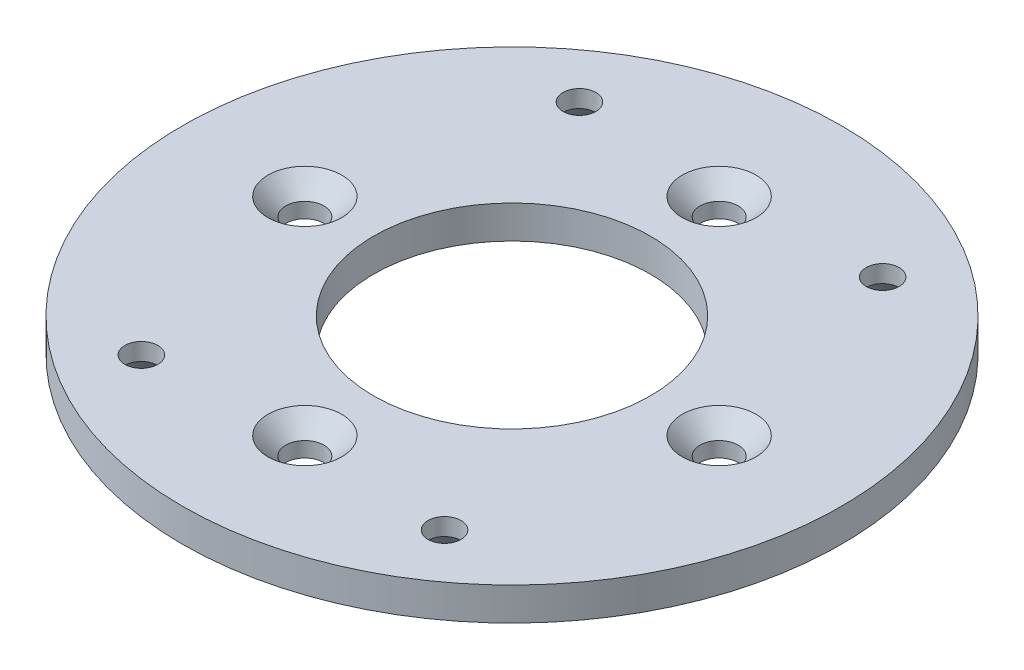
ISO-10303-21;
HEADER;
FILE_DESCRIPTION(('STEP AP214'),'2;1');
FILE_NAME('part.step','',(''),(''),'','','');
FILE_SCHEMA(('AUTOMOTIVE_DESIGN { 1 0 10303 214 1 1 1 1 }'));
ENDSEC;
DATA;
#1=APPLICATION_CONTEXT('core data for automotive mechanical design processes');
#2=APPLICATION_PROTOCOL_DEFINITION('international standard','automotive_design',2000,#1);
#3=PRODUCT_CONTEXT('',#1,'mechanical');
#4=PRODUCT('Part','Part','',(#3));
#5=PRODUCT_RELATED_PRODUCT_CATEGORY('part','',(#4));
#6=PRODUCT_DEFINITION_FORMATION('','',#4);
#7=PRODUCT_DEFINITION_CONTEXT('part definition',#1,'design');
#8=PRODUCT_DEFINITION('design','',#6,#7);
#9=PRODUCT_DEFINITION_SHAPE('','',#8);
#10=(LENGTH_UNIT() NAMED_UNIT(*) SI_UNIT(.MILLI.,.METRE.));
#11=(NAMED_UNIT(*) PLANE_ANGLE_UNIT() SI_UNIT($,.RADIAN.));
#12=(NAMED_UNIT(*) SI_UNIT($,.STERADIAN.) SOLID_ANGLE_UNIT());
#13=UNCERTAINTY_MEASURE_WITH_UNIT(LENGTH_MEASURE(1.E-05),#10,'distance_accuracy_value','');
#14=(GEOMETRIC_REPRESENTATION_CONTEXT(3) GLOBAL_UNCERTAINTY_ASSIGNED_CONTEXT((#13)) GLOBAL_UNIT_ASSIGNED_CONTEXT((#10,
#11,#12)) REPRESENTATION_CONTEXT('',''));
#15=CARTESIAN_POINT('',(0.,0.,0.));
#16=DIRECTION('',(0.,0.,1.));
#17=DIRECTION('',(1.,0.,0.));
#18=AXIS2_PLACEMENT_3D('',#15,#16,#17);
#19=CARTESIAN_POINT('',(0.,-2.,0.));
#20=DIRECTION('',(0.,1.,0.));
#21=DIRECTION('',(0.,0.,1.));
#22=AXIS2_PLACEMENT_3D('',#19,#20,#21);
#23=PLANE('',#22);
#24=CARTESIAN_POINT('',(0.,-2.,0.));
#25=DIRECTION('',(0.,1.,0.));
#26=DIRECTION('',(0.,0.,1.));
#27=AXIS2_PLACEMENT_3D('',#24,#25,#26);
#28=CIRCLE('',#27,50.);
#29=CARTESIAN_POINT('',(0.,-2.,50.));
#30=VERTEX_POINT('',#29);
#31=EDGE_CURVE('E56',#30,#30,#28,.T.);
#32=ORIENTED_EDGE('',*,*,#31,.F.);
#33=EDGE_LOOP('',(#32));
#34=FACE_BOUND('',#33,.T.);
#35=CARTESIAN_POINT('',(0.,-2.,0.));
#36=DIRECTION('',(0.,1.,0.));
#37=DIRECTION('',(0.,0.,1.));
#38=AXIS2_PLACEMENT_3D('',#35,#36,#37);
#39=CIRCLE('',#38,21.);
#40=CARTESIAN_POINT('',(0.,-2.,21.));
#41=VERTEX_POINT('',#40);
#42=EDGE_CURVE('E59',#41,#41,#39,.T.);
#43=ORIENTED_EDGE('',*,*,#42,.T.);
#44=EDGE_LOOP('',(#43));
#45=FACE_BOUND('',#44,.T.);
#46=CARTESIAN_POINT('',(-31.4285714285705,-2.,8.93253724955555E-13));
#47=DIRECTION('',(0.,1.,0.));
#48=DIRECTION('',(0.,0.,1.));
#49=AXIS2_PLACEMENT_3D('',#46,#47,#48);
#50=CIRCLE('',#49,2.9);
#51=CARTESIAN_POINT('',(-31.4285714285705,-2.,2.90000000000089));
#52=VERTEX_POINT('',#51);
#53=EDGE_CURVE('E63',#52,#52,#50,.T.);
#54=ORIENTED_EDGE('',*,*,#53,.T.);
#55=EDGE_LOOP('',(#54));
#56=FACE_BOUND('',#55,.T.);
#57=CARTESIAN_POINT('',(1.78108401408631E-12,-2.,31.4285714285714));
#58=DIRECTION('',(0.,1.,0.));
#59=DIRECTION('',(0.,0.,1.));
#60=AXIS2_PLACEMENT_3D('',#57,#58,#59);
#61=CIRCLE('',#60,2.9);
#62=CARTESIAN_POINT('',(1.78108401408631E-12,-2.,34.3285714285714));
#63=VERTEX_POINT('',#62);
#64=EDGE_CURVE('E74',#63,#63,#61,.T.);
#65=ORIENTED_EDGE('',*,*,#64,.T.);
#66=EDGE_LOOP('',(#65));
#67=FACE_BOUND('',#66,.T.);
#68=CARTESIAN_POINT('',(31.4285714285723,-2.,-8.89404835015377E-13));
#69=DIRECTION('',(0.,1.,0.));
#70=DIRECTION('',(0.,0.,1.));
#71=AXIS2_PLACEMENT_3D('',#68,#69,#70);
#72=CIRCLE('',#71,2.9);
#73=CARTESIAN_POINT('',(31.4285714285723,-2.,2.89999999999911));
#74=VERTEX_POINT('',#73);
#75=EDGE_CURVE('E83',#74,#74,#72,.T.);
#76=ORIENTED_EDGE('',*,*,#75,.T.);
#77=EDGE_LOOP('',(#76));
#78=FACE_BOUND('',#77,.T.);
#79=CARTESIAN_POINT('',(0.,-2.,-31.4285714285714));
#80=DIRECTION('',(0.,1.,0.));
#81=DIRECTION('',(0.,0.,1.));
#82=AXIS2_PLACEMENT_3D('',#79,#80,#81);
#83=CIRCLE('',#82,2.9);
#84=CARTESIAN_POINT('',(0.,-2.,-28.5285714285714));
#85=VERTEX_POINT('',#84);
#86=EDGE_CURVE('E92',#85,#85,#83,.T.);
#87=ORIENTED_EDGE('',*,*,#86,.T.);
#88=EDGE_LOOP('',(#87));
#89=FACE_BOUND('',#88,.T.);
#90=CARTESIAN_POINT('',(-23.,-2.,-33.2340187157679));
#91=DIRECTION('',(0.,-1.,0.));
#92=DIRECTION('',(0.,0.,-1.));
#93=AXIS2_PLACEMENT_3D('',#90,#91,#92);
#94=CIRCLE('',#93,4.5593);
#95=CARTESIAN_POINT('',(-23.,-2.,-37.7933187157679));
#96=VERTEX_POINT('',#95);
#97=EDGE_CURVE('E104',#96,#96,#94,.T.);
#98=ORIENTED_EDGE('',*,*,#97,.F.);
#99=EDGE_LOOP('',(#98));
#100=FACE_BOUND('',#99,.T.);
#101=CARTESIAN_POINT('',(23.,-2.,-33.2340187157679));
#102=DIRECTION('',(0.,-1.,0.));
#103=DIRECTION('',(0.,0.,-1.));
#104=AXIS2_PLACEMENT_3D('',#101,#102,#103);
#105=CIRCLE('',#104,4.5593);
#106=CARTESIAN_POINT('',(23.,-2.,-37.7933187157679));
#107=VERTEX_POINT('',#106);
#108=EDGE_CURVE('E110',#107,#107,#105,.T.);
#109=ORIENTED_EDGE('',*,*,#108,.F.);
#110=EDGE_LOOP('',(#109));
#111=FACE_BOUND('',#110,.T.);
#112=CARTESIAN_POINT('',(23.,-2.,33.2340187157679));
#113=DIRECTION('',(0.,-1.,0.));
#114=DIRECTION('',(0.,0.,-1.));
#115=AXIS2_PLACEMENT_3D('',#112,#113,#114);
#116=CIRCLE('',#115,4.5593);
#117=CARTESIAN_POINT('',(23.,-2.,28.6747187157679));
#118=VERTEX_POINT('',#117);
#119=EDGE_CURVE('E116',#118,#118,#116,.T.);
#120=ORIENTED_EDGE('',*,*,#119,.F.);
#121=EDGE_LOOP('',(#120));
#122=FACE_BOUND('',#121,.T.);
#123=CARTESIAN_POINT('',(-23.,-2.,33.2340187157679));
#124=DIRECTION('',(0.,-1.,0.));
#125=DIRECTION('',(0.,0.,-1.));
#126=AXIS2_PLACEMENT_3D('',#123,#124,#125);
#127=CIRCLE('',#126,4.5593);
#128=CARTESIAN_POINT('',(-23.,-2.,28.6747187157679));
#129=VERTEX_POINT('',#128);
#130=EDGE_CURVE('E122',#129,#129,#127,.T.);
#131=ORIENTED_EDGE('',*,*,#130,.F.);
#132=EDGE_LOOP('',(#131));
#133=FACE_BOUND('',#132,.T.);
#134=ADVANCED_FACE('F33',(#34,#45,#56,#67,#78,#89,#100,#111,#122,#133),#23,.F.);
#135=CARTESIAN_POINT('',(0.,3.,0.));
#136=DIRECTION('',(0.,-1.,0.));
#137=DIRECTION('',(0.,0.,-1.));
#138=AXIS2_PLACEMENT_3D('',#135,#136,#137);
#139=CYLINDRICAL_SURFACE('',#138,50.);
#140=CARTESIAN_POINT('',(0.,3.,0.));
#141=DIRECTION('',(0.,1.,0.));
#142=DIRECTION('',(0.,0.,1.));
#143=AXIS2_PLACEMENT_3D('',#140,#141,#142);
#144=CIRCLE('',#143,50.);
#145=CARTESIAN_POINT('',(0.,3.,50.));
#146=VERTEX_POINT('',#145);
#147=EDGE_CURVE('E11',#146,#146,#144,.T.);
#148=ORIENTED_EDGE('',*,*,#147,.F.);
#149=EDGE_LOOP('',(#148));
#150=FACE_BOUND('',#149,.T.);
#151=ORIENTED_EDGE('',*,*,#31,.T.);
#152=EDGE_LOOP('',(#151));
#153=FACE_BOUND('',#152,.T.);
#154=ADVANCED_FACE('F35',(#150,#153),#139,.T.);
#155=CARTESIAN_POINT('',(0.,3.,0.));
#156=DIRECTION('',(0.,1.,0.));
#157=DIRECTION('',(0.,0.,1.));
#158=AXIS2_PLACEMENT_3D('',#155,#156,#157);
#159=PLANE('',#158);
#160=CARTESIAN_POINT('',(0.,3.,-31.4285714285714));
#161=DIRECTION('',(0.,1.,0.));
#162=DIRECTION('',(0.,0.,1.));
#163=AXIS2_PLACEMENT_3D('',#160,#161,#162);
#164=CIRCLE('',#163,5.6);
#165=CARTESIAN_POINT('',(0.,3.,-25.8285714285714));
#166=VERTEX_POINT('',#165);
#167=EDGE_CURVE('E98',#166,#166,#164,.T.);
#168=ORIENTED_EDGE('',*,*,#167,.F.);
#169=EDGE_LOOP('',(#168));
#170=FACE_BOUND('',#169,.T.);
#171=CARTESIAN_POINT('',(31.4285714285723,3.,-8.89404835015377E-13));
#172=DIRECTION('',(0.,1.,0.));
#173=DIRECTION('',(0.,0.,1.));
#174=AXIS2_PLACEMENT_3D('',#171,#172,#173);
#175=CIRCLE('',#174,5.6);
#176=CARTESIAN_POINT('',(31.4285714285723,3.,5.59999999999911));
#177=VERTEX_POINT('',#176);
#178=EDGE_CURVE('E89',#177,#177,#175,.T.);
#179=ORIENTED_EDGE('',*,*,#178,.F.);
#180=EDGE_LOOP('',(#179));
#181=FACE_BOUND('',#180,.T.);
#182=CARTESIAN_POINT('',(1.78108401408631E-12,3.,31.4285714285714));
#183=DIRECTION('',(0.,1.,0.));
#184=DIRECTION('',(0.,0.,1.));
#185=AXIS2_PLACEMENT_3D('',#182,#183,#184);
#186=CIRCLE('',#185,5.6);
#187=CARTESIAN_POINT('',(1.78108401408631E-12,3.,37.0285714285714));
#188=VERTEX_POINT('',#187);
#189=EDGE_CURVE('E80',#188,#188,#186,.T.);
#190=ORIENTED_EDGE('',*,*,#189,.F.);
#191=EDGE_LOOP('',(#190));
#192=FACE_BOUND('',#191,.T.);
#193=CARTESIAN_POINT('',(-31.4285714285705,3.,8.93253724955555E-13));
#194=DIRECTION('',(0.,1.,0.));
#195=DIRECTION('',(0.,0.,1.));
#196=AXIS2_PLACEMENT_3D('',#193,#194,#195);
#197=CIRCLE('',#196,5.6);
#198=CARTESIAN_POINT('',(-31.4285714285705,3.,5.60000000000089));
#199=VERTEX_POINT('',#198);
#200=EDGE_CURVE('E71',#199,#199,#197,.T.);
#201=ORIENTED_EDGE('',*,*,#200,.F.);
#202=EDGE_LOOP('',(#201));
#203=FACE_BOUND('',#202,.T.);
#204=CARTESIAN_POINT('',(0.,3.,0.));
#205=DIRECTION('',(0.,1.,0.));
#206=DIRECTION('',(0.,0.,1.));
#207=AXIS2_PLACEMENT_3D('',#204,#205,#206);
#208=CIRCLE('',#207,21.);
#209=CARTESIAN_POINT('',(0.,3.,21.));
#210=VERTEX_POINT('',#209);
#211=EDGE_CURVE('E60',#210,#210,#208,.T.);
#212=ORIENTED_EDGE('',*,*,#211,.F.);
#213=EDGE_LOOP('',(#212));
#214=FACE_BOUND('',#213,.T.);
#215=CARTESIAN_POINT('',(-23.,3.,33.2340187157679));
#216=DIRECTION('',(0.,1.,0.));
#217=DIRECTION('',(0.,0.,-1.));
#218=AXIS2_PLACEMENT_3D('',#215,#216,#217);
#219=CIRCLE('',#218,2.5);
#220=CARTESIAN_POINT('',(-23.,3.,30.7340187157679));
#221=VERTEX_POINT('',#220);
#222=EDGE_CURVE('E53',#221,#221,#219,.T.);
#223=ORIENTED_EDGE('',*,*,#222,.F.);
#224=EDGE_LOOP('',(#223));
#225=FACE_BOUND('',#224,.T.);
#226=CARTESIAN_POINT('',(23.,3.,33.2340187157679));
#227=DIRECTION('',(0.,1.,0.));
#228=DIRECTION('',(0.,0.,1.));
#229=AXIS2_PLACEMENT_3D('',#226,#227,#228);
#230=CIRCLE('',#229,2.5);
#231=CARTESIAN_POINT('',(23.,3.,35.7340187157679));
#232=VERTEX_POINT('',#231);
#233=EDGE_CURVE('E48',#232,#232,#230,.T.);
#234=ORIENTED_EDGE('',*,*,#233,.F.);
#235=EDGE_LOOP('',(#234));
#236=FACE_BOUND('',#235,.T.);
#237=CARTESIAN_POINT('',(23.,3.,-33.2340187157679));
#238=DIRECTION('',(0.,1.,0.));
#239=DIRECTION('',(0.,0.,-1.));
#240=AXIS2_PLACEMENT_3D('',#237,#238,#239);
#241=CIRCLE('',#240,2.5);
#242=CARTESIAN_POINT('',(23.,3.,-35.7340187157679));
#243=VERTEX_POINT('',#242);
#244=EDGE_CURVE('E44',#243,#243,#241,.T.);
#245=ORIENTED_EDGE('',*,*,#244,.F.);
#246=EDGE_LOOP('',(#245));
#247=FACE_BOUND('',#246,.T.);
#248=CARTESIAN_POINT('',(-23.,3.,-33.2340187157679));
#249=DIRECTION('',(0.,1.,0.));
#250=DIRECTION('',(0.,0.,1.));
#251=AXIS2_PLACEMENT_3D('',#248,#249,#250);
#252=CIRCLE('',#251,2.5);
#253=CARTESIAN_POINT('',(-23.,3.,-30.7340187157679));
#254=VERTEX_POINT('',#253);
#255=EDGE_CURVE('E40',#254,#254,#252,.T.);
#256=ORIENTED_EDGE('',*,*,#255,.F.);
#257=EDGE_LOOP('',(#256));
#258=FACE_BOUND('',#257,.T.);
#259=ORIENTED_EDGE('',*,*,#147,.T.);
#260=EDGE_LOOP('',(#259));
#261=FACE_BOUND('',#260,.T.);
#262=ADVANCED_FACE('F135',(#170,#181,#192,#203,#214,#225,#236,#247,#258,#261),#159,.T.);
#263=CARTESIAN_POINT('',(-23.,0.,-33.2340187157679));
#264=DIRECTION('',(0.,1.,0.));
#265=DIRECTION('',(0.,0.,1.));
#266=AXIS2_PLACEMENT_3D('',#263,#264,#265);
#267=CYLINDRICAL_SURFACE('',#266,2.5);
#268=CARTESIAN_POINT('',(-23.,0.368953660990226,-33.2340187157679));
#269=DIRECTION('',(0.,-1.,0.));
#270=DIRECTION('',(0.,0.,-1.));
#271=AXIS2_PLACEMENT_3D('',#268,#269,#270);
#272=CIRCLE('',#271,2.5);
#273=CARTESIAN_POINT('',(-23.,0.368953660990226,-35.7340187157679));
#274=VERTEX_POINT('',#273);
#275=EDGE_CURVE('E101',#274,#274,#272,.T.);
#276=ORIENTED_EDGE('',*,*,#275,.T.);
#277=EDGE_LOOP('',(#276));
#278=FACE_BOUND('',#277,.T.);
#279=ORIENTED_EDGE('',*,*,#255,.T.);
#280=EDGE_LOOP('',(#279));
#281=FACE_BOUND('',#280,.T.);
#282=ADVANCED_FACE('F154',(#278,#281),#267,.F.);
#283=CARTESIAN_POINT('',(23.,0.,-33.2340187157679));
#284=DIRECTION('',(0.,1.,0.));
#285=DIRECTION('',(0.,0.,1.));
#286=AXIS2_PLACEMENT_3D('',#283,#284,#285);
#287=CYLINDRICAL_SURFACE('',#286,2.5);
#288=CARTESIAN_POINT('',(23.,0.368953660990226,-33.2340187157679));
#289=DIRECTION('',(0.,-1.,0.));
#290=DIRECTION('',(0.,0.,-1.));
#291=AXIS2_PLACEMENT_3D('',#288,#289,#290);
#292=CIRCLE('',#291,2.5);
#293=CARTESIAN_POINT('',(23.,0.368953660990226,-35.7340187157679));
#294=VERTEX_POINT('',#293);
#295=EDGE_CURVE('E107',#294,#294,#292,.T.);
#296=ORIENTED_EDGE('',*,*,#295,.T.);
#297=EDGE_LOOP('',(#296));
#298=FACE_BOUND('',#297,.T.);
#299=ORIENTED_EDGE('',*,*,#244,.T.);
#300=EDGE_LOOP('',(#299));
#301=FACE_BOUND('',#300,.T.);
#302=ADVANCED_FACE('F150',(#298,#301),#287,.F.);
#303=CARTESIAN_POINT('',(23.,0.,33.2340187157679));
#304=DIRECTION('',(0.,1.,0.));
#305=DIRECTION('',(0.,0.,1.));
#306=AXIS2_PLACEMENT_3D('',#303,#304,#305);
#307=CYLINDRICAL_SURFACE('',#306,2.5);
#308=CARTESIAN_POINT('',(23.,0.368953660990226,33.2340187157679));
#309=DIRECTION('',(0.,-1.,0.));
#310=DIRECTION('',(0.,0.,-1.));
#311=AXIS2_PLACEMENT_3D('',#308,#309,#310);
#312=CIRCLE('',#311,2.5);
#313=CARTESIAN_POINT('',(23.,0.368953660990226,30.7340187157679));
#314=VERTEX_POINT('',#313);
#315=EDGE_CURVE('E113',#314,#314,#312,.T.);
#316=ORIENTED_EDGE('',*,*,#315,.T.);
#317=EDGE_LOOP('',(#316));
#318=FACE_BOUND('',#317,.T.);
#319=ORIENTED_EDGE('',*,*,#233,.T.);
#320=EDGE_LOOP('',(#319));
#321=FACE_BOUND('',#320,.T.);
#322=ADVANCED_FACE('F146',(#318,#321),#307,.F.);
#323=CARTESIAN_POINT('',(-23.,0.,33.2340187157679));
#324=DIRECTION('',(0.,1.,0.));
#325=DIRECTION('',(0.,0.,1.));
#326=AXIS2_PLACEMENT_3D('',#323,#324,#325);
#327=CYLINDRICAL_SURFACE('',#326,2.5);
#328=CARTESIAN_POINT('',(-23.,0.368953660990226,33.2340187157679));
#329=DIRECTION('',(0.,-1.,0.));
#330=DIRECTION('',(0.,0.,-1.));
#331=AXIS2_PLACEMENT_3D('',#328,#329,#330);
#332=CIRCLE('',#331,2.5);
#333=CARTESIAN_POINT('',(-23.,0.368953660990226,30.7340187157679));
#334=VERTEX_POINT('',#333);
#335=EDGE_CURVE('E119',#334,#334,#332,.T.);
#336=ORIENTED_EDGE('',*,*,#335,.T.);
#337=EDGE_LOOP('',(#336));
#338=FACE_BOUND('',#337,.T.);
#339=ORIENTED_EDGE('',*,*,#222,.T.);
#340=EDGE_LOOP('',(#339));
#341=FACE_BOUND('',#340,.T.);
#342=ADVANCED_FACE('F143',(#338,#341),#327,.F.);
#343=CARTESIAN_POINT('',(0.,-2.,0.));
#344=DIRECTION('',(0.,1.,0.));
#345=DIRECTION('',(0.,0.,1.));
#346=AXIS2_PLACEMENT_3D('',#343,#344,#345);
#347=CYLINDRICAL_SURFACE('',#346,21.);
#348=CARTESIAN_POINT('',(0.,-2.,21.));
#349=CARTESIAN_POINT('',(0.,-1.94791666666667,21.));
#350=CARTESIAN_POINT('',(0.,-1.89583333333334,21.));
#351=CARTESIAN_POINT('',(0.,-1.79166666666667,21.));
#352=CARTESIAN_POINT('',(0.,-1.73958333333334,21.));
#353=CARTESIAN_POINT('',(0.,-1.63541666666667,21.));
#354=CARTESIAN_POINT('',(0.,-1.58333333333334,21.));
#355=CARTESIAN_POINT('',(0.,-1.47916666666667,21.));
#356=CARTESIAN_POINT('',(0.,-1.42708333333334,21.));
#357=CARTESIAN_POINT('',(0.,-1.32291666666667,21.));
#358=CARTESIAN_POINT('',(0.,-1.27083333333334,21.));
#359=CARTESIAN_POINT('',(0.,-1.16666666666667,21.));
#360=CARTESIAN_POINT('',(0.,-1.11458333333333,21.));
#361=CARTESIAN_POINT('',(0.,-1.01041666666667,21.));
#362=CARTESIAN_POINT('',(0.,-0.958333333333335,21.));
#363=CARTESIAN_POINT('',(0.,-0.854166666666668,21.));
#364=CARTESIAN_POINT('',(0.,-0.802083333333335,21.));
#365=CARTESIAN_POINT('',(0.,-0.697916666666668,21.));
#366=CARTESIAN_POINT('',(0.,-0.645833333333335,21.));
#367=CARTESIAN_POINT('',(0.,-0.541666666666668,21.));
#368=CARTESIAN_POINT('',(0.,-0.489583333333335,21.));
#369=CARTESIAN_POINT('',(0.,-0.385416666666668,21.));
#370=CARTESIAN_POINT('',(0.,-0.333333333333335,21.));
#371=CARTESIAN_POINT('',(0.,-0.229166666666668,21.));
#372=CARTESIAN_POINT('',(0.,-0.177083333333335,21.));
#373=CARTESIAN_POINT('',(0.,-0.0729166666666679,21.));
#374=CARTESIAN_POINT('',(0.,-0.0208333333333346,21.));
#375=CARTESIAN_POINT('',(0.,0.0833333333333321,21.));
#376=CARTESIAN_POINT('',(0.,0.135416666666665,21.));
#377=CARTESIAN_POINT('',(0.,0.239583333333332,21.));
#378=CARTESIAN_POINT('',(0.,0.291666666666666,21.));
#379=CARTESIAN_POINT('',(0.,0.395833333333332,21.));
#380=CARTESIAN_POINT('',(0.,0.447916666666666,21.));
#381=CARTESIAN_POINT('',(0.,0.552083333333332,21.));
#382=CARTESIAN_POINT('',(0.,0.604166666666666,21.));
#383=CARTESIAN_POINT('',(0.,0.708333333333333,21.));
#384=CARTESIAN_POINT('',(0.,0.760416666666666,21.));
#385=CARTESIAN_POINT('',(0.,0.864583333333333,21.));
#386=CARTESIAN_POINT('',(0.,0.916666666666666,21.));
#387=CARTESIAN_POINT('',(0.,1.02083333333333,21.));
#388=CARTESIAN_POINT('',(0.,1.07291666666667,21.));
#389=CARTESIAN_POINT('',(0.,1.17708333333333,21.));
#390=CARTESIAN_POINT('',(0.,1.22916666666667,21.));
#391=CARTESIAN_POINT('',(0.,1.33333333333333,21.));
#392=CARTESIAN_POINT('',(0.,1.38541666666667,21.));
#393=CARTESIAN_POINT('',(0.,1.48958333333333,21.));
#394=CARTESIAN_POINT('',(0.,1.54166666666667,21.));
#395=CARTESIAN_POINT('',(0.,1.64583333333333,21.));
#396=CARTESIAN_POINT('',(0.,1.69791666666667,21.));
#397=CARTESIAN_POINT('',(0.,1.80208333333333,21.));
#398=CARTESIAN_POINT('',(0.,1.85416666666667,21.));
#399=CARTESIAN_POINT('',(0.,1.95833333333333,21.));
#400=CARTESIAN_POINT('',(0.,2.01041666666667,21.));
#401=CARTESIAN_POINT('',(0.,2.11458333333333,21.));
#402=CARTESIAN_POINT('',(0.,2.16666666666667,21.));
#403=CARTESIAN_POINT('',(0.,2.27083333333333,21.));
#404=CARTESIAN_POINT('',(0.,2.32291666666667,21.));
#405=CARTESIAN_POINT('',(0.,2.42708333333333,21.));
#406=CARTESIAN_POINT('',(0.,2.47916666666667,21.));
#407=CARTESIAN_POINT('',(0.,2.58333333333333,21.));
#408=CARTESIAN_POINT('',(0.,2.63541666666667,21.));
#409=CARTESIAN_POINT('',(0.,2.73958333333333,21.));
#410=CARTESIAN_POINT('',(0.,2.79166666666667,21.));
#411=CARTESIAN_POINT('',(0.,2.89583333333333,21.));
#412=CARTESIAN_POINT('',(0.,2.94791666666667,21.));
#413=CARTESIAN_POINT('',(0.,3.,21.));
#414=B_SPLINE_CURVE_WITH_KNOTS('',3,(#348,#349,#350,#351,#352,#353,#354,#355,#356,#357,#358,
#359,#360,#361,#362,#363,#364,#365,#366,#367,#368,#369,#370,#371,#372,#373,#374,#375,#376,#377,
#378,#379,#380,#381,#382,#383,#384,#385,#386,#387,#388,#389,#390,#391,#392,#393,#394,#395,#396,
#397,#398,#399,#400,#401,#402,#403,#404,#405,#406,#407,#408,#409,#410,#411,#412,#413),
.UNSPECIFIED.,.F.,.F.,(4,2,2,2,2,2,2,2,2,2,2,2,2,2,2,2,2,2,2,2,2,2,2,2,2,2,2,2,2,2,2,2,4),(0.,
0.15625,0.3125,0.46875,0.625,0.78125,0.9375,1.09375,1.25,1.40625,1.5625,1.71875,1.875,2.03125,
2.1875,2.34375,2.5,2.65625,2.8125,2.96875,3.125,3.28125,3.4375,3.59375,3.75,3.90625,4.0625,
4.21875,4.375,4.53125,4.6875,4.84375,5.),.UNSPECIFIED.);
#415=EDGE_CURVE('BSEAM141',#41,#210,#414,.T.);
#416=ORIENTED_EDGE('',*,*,#42,.F.);
#417=ORIENTED_EDGE('',*,*,#211,.T.);
#418=ORIENTED_EDGE('',*,*,#415,.T.);
#419=ORIENTED_EDGE('',*,*,#415,.F.);
#420=EDGE_LOOP('',(#416,#418,#417,#419));
#421=FACE_BOUND('',#420,.T.);
#422=ADVANCED_FACE('F141',(#421),#347,.F.);
#423=CARTESIAN_POINT('',(-31.4285714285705,3.,8.93253724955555E-13));
#424=DIRECTION('',(0.,1.,0.));
#425=DIRECTION('',(0.,0.,1.));
#426=AXIS2_PLACEMENT_3D('',#423,#424,#425);
#427=CYLINDRICAL_SURFACE('',#426,2.9);
#428=ORIENTED_EDGE('',*,*,#53,.F.);
#429=EDGE_LOOP('',(#428));
#430=FACE_BOUND('',#429,.T.);
#431=CARTESIAN_POINT('',(-31.4285714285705,0.300000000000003,8.93253724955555E-13));
#432=DIRECTION('',(0.,1.,0.));
#433=DIRECTION('',(0.,0.,1.));
#434=AXIS2_PLACEMENT_3D('',#431,#432,#433);
#435=CIRCLE('',#434,2.9);
#436=CARTESIAN_POINT('',(-31.4285714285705,0.300000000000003,2.90000000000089));
#437=VERTEX_POINT('',#436);
#438=EDGE_CURVE('E68',#437,#437,#435,.T.);
#439=ORIENTED_EDGE('',*,*,#438,.T.);
#440=EDGE_LOOP('',(#439));
#441=FACE_BOUND('',#440,.T.);
#442=ADVANCED_FACE('F183',(#430,#441),#427,.F.);
#443=CARTESIAN_POINT('',(-31.4285714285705,3.,8.93253724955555E-13));
#444=DIRECTION('',(0.,1.,0.));
#445=DIRECTION('',(0.,0.,1.));
#446=AXIS2_PLACEMENT_3D('',#443,#444,#445);
#447=CONICAL_SURFACE('',#446,5.6,0.785398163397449);
#448=ORIENTED_EDGE('',*,*,#438,.F.);
#449=EDGE_LOOP('',(#448));
#450=FACE_BOUND('',#449,.T.);
#451=ORIENTED_EDGE('',*,*,#200,.T.);
#452=EDGE_LOOP('',(#451));
#453=FACE_BOUND('',#452,.T.);
#454=ADVANCED_FACE('F188',(#450,#453),#447,.F.);
#455=CARTESIAN_POINT('',(1.78108401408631E-12,3.,31.4285714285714));
#456=DIRECTION('',(0.,1.,0.));
#457=DIRECTION('',(0.,0.,1.));
#458=AXIS2_PLACEMENT_3D('',#455,#456,#457);
#459=CYLINDRICAL_SURFACE('',#458,2.9);
#460=ORIENTED_EDGE('',*,*,#64,.F.);
#461=EDGE_LOOP('',(#460));
#462=FACE_BOUND('',#461,.T.);
#463=CARTESIAN_POINT('',(1.78108401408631E-12,0.300000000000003,31.4285714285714));
#464=DIRECTION('',(0.,1.,0.));
#465=DIRECTION('',(0.,0.,1.));
#466=AXIS2_PLACEMENT_3D('',#463,#464,#465);
#467=CIRCLE('',#466,2.9);
#468=CARTESIAN_POINT('',(1.78108401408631E-12,0.300000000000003,34.3285714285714));
#469=VERTEX_POINT('',#468);
#470=EDGE_CURVE('E77',#469,#469,#467,.T.);
#471=ORIENTED_EDGE('',*,*,#470,.T.);
#472=EDGE_LOOP('',(#471));
#473=FACE_BOUND('',#472,.T.);
#474=ADVANCED_FACE('F243',(#462,#473),#459,.F.);
#475=CARTESIAN_POINT('',(1.78108401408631E-12,3.,31.4285714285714));
#476=DIRECTION('',(0.,1.,0.));
#477=DIRECTION('',(0.,0.,1.));
#478=AXIS2_PLACEMENT_3D('',#475,#476,#477);
#479=CONICAL_SURFACE('',#478,5.6,0.785398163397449);
#480=ORIENTED_EDGE('',*,*,#470,.F.);
#481=EDGE_LOOP('',(#480));
#482=FACE_BOUND('',#481,.T.);
#483=ORIENTED_EDGE('',*,*,#189,.T.);
#484=EDGE_LOOP('',(#483));
#485=FACE_BOUND('',#484,.T.);
#486=ADVANCED_FACE('F239',(#482,#485),#479,.F.);
#487=CARTESIAN_POINT('',(31.4285714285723,3.,-8.89404835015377E-13));
#488=DIRECTION('',(0.,1.,0.));
#489=DIRECTION('',(0.,0.,1.));
#490=AXIS2_PLACEMENT_3D('',#487,#488,#489);
#491=CYLINDRICAL_SURFACE('',#490,2.9);
#492=ORIENTED_EDGE('',*,*,#75,.F.);
#493=EDGE_LOOP('',(#492));
#494=FACE_BOUND('',#493,.T.);
#495=CARTESIAN_POINT('',(31.4285714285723,0.300000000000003,-8.89404835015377E-13));
#496=DIRECTION('',(0.,1.,0.));
#497=DIRECTION('',(0.,0.,1.));
#498=AXIS2_PLACEMENT_3D('',#495,#496,#497);
#499=CIRCLE('',#498,2.9);
#500=CARTESIAN_POINT('',(31.4285714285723,0.300000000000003,2.89999999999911));
#501=VERTEX_POINT('',#500);
#502=EDGE_CURVE('E86',#501,#501,#499,.T.);
#503=ORIENTED_EDGE('',*,*,#502,.T.);
#504=EDGE_LOOP('',(#503));
#505=FACE_BOUND('',#504,.T.);
#506=ADVANCED_FACE('F235',(#494,#505),#491,.F.);
#507=CARTESIAN_POINT('',(31.4285714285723,3.,-8.89404835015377E-13));
#508=DIRECTION('',(0.,1.,0.));
#509=DIRECTION('',(0.,0.,1.));
#510=AXIS2_PLACEMENT_3D('',#507,#508,#509);
#511=CONICAL_SURFACE('',#510,5.6,0.785398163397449);
#512=ORIENTED_EDGE('',*,*,#502,.F.);
#513=EDGE_LOOP('',(#512));
#514=FACE_BOUND('',#513,.T.);
#515=ORIENTED_EDGE('',*,*,#178,.T.);
#516=EDGE_LOOP('',(#515));
#517=FACE_BOUND('',#516,.T.);
#518=ADVANCED_FACE('F231',(#514,#517),#511,.F.);
#519=CARTESIAN_POINT('',(0.,3.,-31.4285714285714));
#520=DIRECTION('',(0.,1.,0.));
#521=DIRECTION('',(0.,0.,1.));
#522=AXIS2_PLACEMENT_3D('',#519,#520,#521);
#523=CYLINDRICAL_SURFACE('',#522,2.9);
#524=ORIENTED_EDGE('',*,*,#86,.F.);
#525=EDGE_LOOP('',(#524));
#526=FACE_BOUND('',#525,.T.);
#527=CARTESIAN_POINT('',(0.,0.300000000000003,-31.4285714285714));
#528=DIRECTION('',(0.,1.,0.));
#529=DIRECTION('',(0.,0.,1.));
#530=AXIS2_PLACEMENT_3D('',#527,#528,#529);
#531=CIRCLE('',#530,2.9);
#532=CARTESIAN_POINT('',(0.,0.300000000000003,-28.5285714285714));
#533=VERTEX_POINT('',#532);
#534=EDGE_CURVE('E95',#533,#533,#531,.T.);
#535=ORIENTED_EDGE('',*,*,#534,.T.);
#536=EDGE_LOOP('',(#535));
#537=FACE_BOUND('',#536,.T.);
#538=ADVANCED_FACE('F227',(#526,#537),#523,.F.);
#539=CARTESIAN_POINT('',(0.,3.,-31.4285714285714));
#540=DIRECTION('',(0.,1.,0.));
#541=DIRECTION('',(0.,0.,1.));
#542=AXIS2_PLACEMENT_3D('',#539,#540,#541);
#543=CONICAL_SURFACE('',#542,5.6,0.785398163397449);
#544=ORIENTED_EDGE('',*,*,#534,.F.);
#545=EDGE_LOOP('',(#544));
#546=FACE_BOUND('',#545,.T.);
#547=ORIENTED_EDGE('',*,*,#167,.T.);
#548=EDGE_LOOP('',(#547));
#549=FACE_BOUND('',#548,.T.);
#550=ADVANCED_FACE('F223',(#546,#549),#543,.F.);
#551=CARTESIAN_POINT('',(-23.,-2.,-33.2340187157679));
#552=DIRECTION('',(0.,-1.,0.));
#553=DIRECTION('',(0.,0.,-1.));
#554=AXIS2_PLACEMENT_3D('',#551,#552,#553);
#555=CONICAL_SURFACE('',#554,4.5593,0.715584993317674);
#556=ORIENTED_EDGE('',*,*,#97,.T.);
#557=EDGE_LOOP('',(#556));
#558=FACE_BOUND('',#557,.T.);
#559=ORIENTED_EDGE('',*,*,#275,.F.);
#560=EDGE_LOOP('',(#559));
#561=FACE_BOUND('',#560,.T.);
#562=ADVANCED_FACE('F217',(#558,#561),#555,.F.);
#563=CARTESIAN_POINT('',(23.,-2.,-33.2340187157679));
#564=DIRECTION('',(0.,-1.,0.));
#565=DIRECTION('',(0.,0.,-1.));
#566=AXIS2_PLACEMENT_3D('',#563,#564,#565);
#567=CONICAL_SURFACE('',#566,4.5593,0.715584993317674);
#568=ORIENTED_EDGE('',*,*,#108,.T.);
#569=EDGE_LOOP('',(#568));
#570=FACE_BOUND('',#569,.T.);
#571=ORIENTED_EDGE('',*,*,#295,.F.);
#572=EDGE_LOOP('',(#571));
#573=FACE_BOUND('',#572,.T.);
#574=ADVANCED_FACE('F209',(#570,#573),#567,.F.);
#575=CARTESIAN_POINT('',(23.,-2.,33.2340187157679));
#576=DIRECTION('',(0.,-1.,0.));
#577=DIRECTION('',(0.,0.,-1.));
#578=AXIS2_PLACEMENT_3D('',#575,#576,#577);
#579=CONICAL_SURFACE('',#578,4.5593,0.715584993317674);
#580=ORIENTED_EDGE('',*,*,#119,.T.);
#581=EDGE_LOOP('',(#580));
#582=FACE_BOUND('',#581,.T.);
#583=ORIENTED_EDGE('',*,*,#315,.F.);
#584=EDGE_LOOP('',(#583));
#585=FACE_BOUND('',#584,.T.);
#586=ADVANCED_FACE('F206',(#582,#585),#579,.F.);
#587=CARTESIAN_POINT('',(-23.,-2.,33.2340187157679));
#588=DIRECTION('',(0.,-1.,0.));
#589=DIRECTION('',(0.,0.,-1.));
#590=AXIS2_PLACEMENT_3D('',#587,#588,#589);
#591=CONICAL_SURFACE('',#590,4.5593,0.715584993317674);
#592=ORIENTED_EDGE('',*,*,#130,.T.);
#593=EDGE_LOOP('',(#592));
#594=FACE_BOUND('',#593,.T.);
#595=ORIENTED_EDGE('',*,*,#335,.F.);
#596=EDGE_LOOP('',(#595));
#597=FACE_BOUND('',#596,.T.);
#598=ADVANCED_FACE('F126',(#594,#597),#591,.F.);
#599=CLOSED_SHELL('',(#134,#154,#262,#282,#302,#322,#342,#422,#442,#454,#474,#486,#506,#518,
#538,#550,#562,#574,#586,#598));
#600=MANIFOLD_SOLID_BREP('B2',#599);
#601=ADVANCED_BREP_SHAPE_REPRESENTATION('',(#18,#600),#14);
#602=SHAPE_DEFINITION_REPRESENTATION(#9,#601);
ENDSEC;
END-ISO-10303-21;
